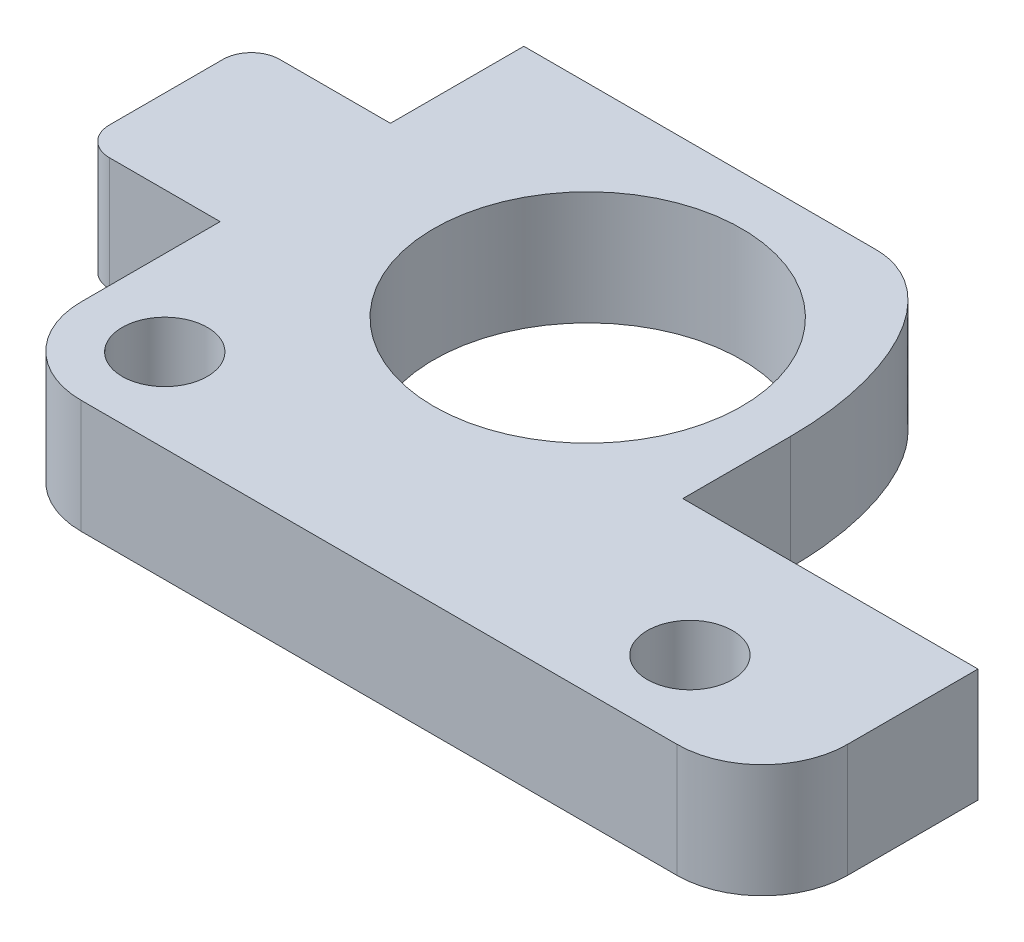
ISO-10303-21;
HEADER;
FILE_DESCRIPTION(('STEP AP214'),'2;1');
FILE_NAME('part.step','',(''),(''),'','','');
FILE_SCHEMA(('AUTOMOTIVE_DESIGN { 1 0 10303 214 1 1 1 1 }'));
ENDSEC;
DATA;
#1=APPLICATION_CONTEXT('core data for automotive mechanical design processes');
#2=APPLICATION_PROTOCOL_DEFINITION('international standard','automotive_design',2000,#1);
#3=PRODUCT_CONTEXT('',#1,'mechanical');
#4=PRODUCT('Part','Part','',(#3));
#5=PRODUCT_RELATED_PRODUCT_CATEGORY('part','',(#4));
#6=PRODUCT_DEFINITION_FORMATION('','',#4);
#7=PRODUCT_DEFINITION_CONTEXT('part definition',#1,'design');
#8=PRODUCT_DEFINITION('design','',#6,#7);
#9=PRODUCT_DEFINITION_SHAPE('','',#8);
#10=(LENGTH_UNIT() NAMED_UNIT(*) SI_UNIT(.MILLI.,.METRE.));
#11=(NAMED_UNIT(*) PLANE_ANGLE_UNIT() SI_UNIT($,.RADIAN.));
#12=(NAMED_UNIT(*) SI_UNIT($,.STERADIAN.) SOLID_ANGLE_UNIT());
#13=UNCERTAINTY_MEASURE_WITH_UNIT(LENGTH_MEASURE(1.E-05),#10,'distance_accuracy_value','');
#14=(GEOMETRIC_REPRESENTATION_CONTEXT(3) GLOBAL_UNCERTAINTY_ASSIGNED_CONTEXT((#13)) GLOBAL_UNIT_ASSIGNED_CONTEXT((#10,
#11,#12)) REPRESENTATION_CONTEXT('',''));
#15=CARTESIAN_POINT('',(0.,0.,0.));
#16=DIRECTION('',(0.,0.,1.));
#17=DIRECTION('',(1.,0.,0.));
#18=AXIS2_PLACEMENT_3D('',#15,#16,#17);
#19=CARTESIAN_POINT('',(-17.4,-2.,1.825));
#20=DIRECTION('',(0.,1.,0.));
#21=DIRECTION('',(0.,0.,1.));
#22=AXIS2_PLACEMENT_3D('',#19,#20,#21);
#23=CYLINDRICAL_SURFACE('',#22,1.);
#24=DIRECTION('',(0.,1.,0.));
#25=VECTOR('',#24,1.);
#26=CARTESIAN_POINT('',(-17.4,-2.,0.825));
#27=LINE('',#26,#25);
#28=CARTESIAN_POINT('',(-17.4,-2.,0.825));
#29=VERTEX_POINT('',#28);
#30=CARTESIAN_POINT('',(-17.4,2.,0.825));
#31=VERTEX_POINT('',#30);
#32=EDGE_CURVE('E157',#29,#31,#27,.T.);
#33=ORIENTED_EDGE('',*,*,#32,.F.);
#34=CARTESIAN_POINT('',(-17.4,-2.,1.825));
#35=DIRECTION('',(0.,1.,0.));
#36=DIRECTION('',(0.,0.,1.));
#37=AXIS2_PLACEMENT_3D('',#34,#35,#36);
#38=CIRCLE('',#37,1.);
#39=CARTESIAN_POINT('',(-18.4,-2.,1.825));
#40=VERTEX_POINT('',#39);
#41=EDGE_CURVE('E373',#29,#40,#38,.T.);
#42=ORIENTED_EDGE('',*,*,#41,.T.);
#43=DIRECTION('',(0.,1.,0.));
#44=VECTOR('',#43,1.);
#45=CARTESIAN_POINT('',(-18.4,-2.,1.825));
#46=LINE('',#45,#44);
#47=CARTESIAN_POINT('',(-18.4,2.,1.825));
#48=VERTEX_POINT('',#47);
#49=EDGE_CURVE('E160',#48,#40,#46,.F.);
#50=ORIENTED_EDGE('',*,*,#49,.F.);
#51=CARTESIAN_POINT('',(-17.4,2.,1.825));
#52=DIRECTION('',(0.,1.,0.));
#53=DIRECTION('',(0.,0.,1.));
#54=AXIS2_PLACEMENT_3D('',#51,#52,#53);
#55=CIRCLE('',#54,1.);
#56=EDGE_CURVE('E20',#48,#31,#55,.F.);
#57=ORIENTED_EDGE('',*,*,#56,.T.);
#58=EDGE_LOOP('',(#33,#42,#50,#57));
#59=FACE_BOUND('',#58,.T.);
#60=ADVANCED_FACE('F17',(#59),#23,.T.);
#61=CARTESIAN_POINT('',(-17.4,-2.,5.825));
#62=DIRECTION('',(0.,1.,0.));
#63=DIRECTION('',(0.,0.,1.));
#64=AXIS2_PLACEMENT_3D('',#61,#62,#63);
#65=CYLINDRICAL_SURFACE('',#64,1.);
#66=DIRECTION('',(0.,1.,0.));
#67=VECTOR('',#66,1.);
#68=CARTESIAN_POINT('',(-18.4,-2.,5.825));
#69=LINE('',#68,#67);
#70=CARTESIAN_POINT('',(-18.4,-2.,5.825));
#71=VERTEX_POINT('',#70);
#72=CARTESIAN_POINT('',(-18.4,2.,5.825));
#73=VERTEX_POINT('',#72);
#74=EDGE_CURVE('E259',#71,#73,#69,.T.);
#75=ORIENTED_EDGE('',*,*,#74,.F.);
#76=CARTESIAN_POINT('',(-17.4,-2.,5.825));
#77=DIRECTION('',(0.,1.,0.));
#78=DIRECTION('',(0.,0.,1.));
#79=AXIS2_PLACEMENT_3D('',#76,#77,#78);
#80=CIRCLE('',#79,1.);
#81=CARTESIAN_POINT('',(-17.4,-2.,6.825));
#82=VERTEX_POINT('',#81);
#83=EDGE_CURVE('E423',#71,#82,#80,.T.);
#84=ORIENTED_EDGE('',*,*,#83,.T.);
#85=DIRECTION('',(0.,1.,0.));
#86=VECTOR('',#85,1.);
#87=CARTESIAN_POINT('',(-17.4,-2.,6.825));
#88=LINE('',#87,#86);
#89=CARTESIAN_POINT('',(-17.4,2.,6.825));
#90=VERTEX_POINT('',#89);
#91=EDGE_CURVE('E252',#90,#82,#88,.F.);
#92=ORIENTED_EDGE('',*,*,#91,.F.);
#93=CARTESIAN_POINT('',(-17.4,2.,5.825));
#94=DIRECTION('',(0.,1.,0.));
#95=DIRECTION('',(0.,0.,1.));
#96=AXIS2_PLACEMENT_3D('',#93,#94,#95);
#97=CIRCLE('',#96,1.);
#98=EDGE_CURVE('E163',#90,#73,#97,.F.);
#99=ORIENTED_EDGE('',*,*,#98,.T.);
#100=EDGE_LOOP('',(#75,#84,#92,#99));
#101=FACE_BOUND('',#100,.T.);
#102=ADVANCED_FACE('F427',(#101),#65,.T.);
#103=CARTESIAN_POINT('',(0.,-2.,0.));
#104=DIRECTION('',(0.,1.,0.));
#105=DIRECTION('',(0.,0.,1.));
#106=AXIS2_PLACEMENT_3D('',#103,#104,#105);
#107=PLANE('',#106);
#108=CARTESIAN_POINT('',(-4.1,-2.,3.275));
#109=DIRECTION('',(0.,1.,0.));
#110=DIRECTION('',(0.,0.,1.));
#111=AXIS2_PLACEMENT_3D('',#108,#109,#110);
#112=CIRCLE('',#111,5.425);
#113=CARTESIAN_POINT('',(-4.1,-2.,8.7));
#114=VERTEX_POINT('',#113);
#115=EDGE_CURVE('E207',#114,#114,#112,.T.);
#116=ORIENTED_EDGE('',*,*,#115,.T.);
#117=EDGE_LOOP('',(#116));
#118=FACE_BOUND('',#117,.T.);
#119=CARTESIAN_POINT('',(-10.5,-2.,11.775));
#120=DIRECTION('',(0.,1.,0.));
#121=DIRECTION('',(0.,0.,1.));
#122=AXIS2_PLACEMENT_3D('',#119,#120,#121);
#123=CIRCLE('',#122,1.5);
#124=CARTESIAN_POINT('',(-10.5,-2.,13.275));
#125=VERTEX_POINT('',#124);
#126=EDGE_CURVE('E397',#125,#125,#123,.T.);
#127=ORIENTED_EDGE('',*,*,#126,.T.);
#128=EDGE_LOOP('',(#127));
#129=FACE_BOUND('',#128,.T.);
#130=CARTESIAN_POINT('',(8.,-2.,11.775));
#131=DIRECTION('',(0.,1.,0.));
#132=DIRECTION('',(0.,0.,1.));
#133=AXIS2_PLACEMENT_3D('',#130,#131,#132);
#134=CIRCLE('',#133,1.5);
#135=CARTESIAN_POINT('',(8.,-2.,13.275));
#136=VERTEX_POINT('',#135);
#137=EDGE_CURVE('E399',#136,#136,#134,.T.);
#138=ORIENTED_EDGE('',*,*,#137,.T.);
#139=EDGE_LOOP('',(#138));
#140=FACE_BOUND('',#139,.T.);
#141=CARTESIAN_POINT('',(10.5,-2.,11.725));
#142=DIRECTION('',(0.,1.,0.));
#143=DIRECTION('',(0.,0.,1.));
#144=AXIS2_PLACEMENT_3D('',#141,#142,#143);
#145=CIRCLE('',#144,3.);
#146=CARTESIAN_POINT('',(10.5,-2.,14.725));
#147=VERTEX_POINT('',#146);
#148=CARTESIAN_POINT('',(13.5,-2.,11.725));
#149=VERTEX_POINT('',#148);
#150=EDGE_CURVE('E215',#147,#149,#145,.T.);
#151=ORIENTED_EDGE('',*,*,#150,.F.);
#152=DIRECTION('',(1.,0.,0.));
#153=VECTOR('',#152,1.);
#154=CARTESIAN_POINT('',(-10.5,-2.,14.725));
#155=LINE('',#154,#153);
#156=CARTESIAN_POINT('',(-10.5,-2.,14.725));
#157=VERTEX_POINT('',#156);
#158=EDGE_CURVE('E234',#157,#147,#155,.T.);
#159=ORIENTED_EDGE('',*,*,#158,.F.);
#160=CARTESIAN_POINT('',(-10.5,-2.,11.725));
#161=DIRECTION('',(0.,1.,0.));
#162=DIRECTION('',(0.,0.,1.));
#163=AXIS2_PLACEMENT_3D('',#160,#161,#162);
#164=CIRCLE('',#163,3.);
#165=CARTESIAN_POINT('',(-13.5,-2.,11.725));
#166=VERTEX_POINT('',#165);
#167=EDGE_CURVE('E239',#166,#157,#164,.T.);
#168=ORIENTED_EDGE('',*,*,#167,.F.);
#169=DIRECTION('',(0.,0.,1.));
#170=VECTOR('',#169,1.);
#171=CARTESIAN_POINT('',(-13.5,-2.,6.825));
#172=LINE('',#171,#170);
#173=CARTESIAN_POINT('',(-13.5,-2.,6.825));
#174=VERTEX_POINT('',#173);
#175=EDGE_CURVE('E244',#174,#166,#172,.T.);
#176=ORIENTED_EDGE('',*,*,#175,.F.);
#177=DIRECTION('',(1.,0.,0.));
#178=VECTOR('',#177,1.);
#179=CARTESIAN_POINT('',(-17.4,-2.,6.825));
#180=LINE('',#179,#178);
#181=EDGE_CURVE('E249',#82,#174,#180,.T.);
#182=ORIENTED_EDGE('',*,*,#181,.F.);
#183=ORIENTED_EDGE('',*,*,#83,.F.);
#184=DIRECTION('',(0.,0.,1.));
#185=VECTOR('',#184,1.);
#186=CARTESIAN_POINT('',(-18.4,-2.,1.825));
#187=LINE('',#186,#185);
#188=EDGE_CURVE('E256',#40,#71,#187,.T.);
#189=ORIENTED_EDGE('',*,*,#188,.F.);
#190=ORIENTED_EDGE('',*,*,#41,.F.);
#191=DIRECTION('',(-1.,0.,0.));
#192=VECTOR('',#191,1.);
#193=CARTESIAN_POINT('',(-13.5,-2.,0.825));
#194=LINE('',#193,#192);
#195=CARTESIAN_POINT('',(-13.5,-2.,0.825));
#196=VERTEX_POINT('',#195);
#197=EDGE_CURVE('E172',#196,#29,#194,.T.);
#198=ORIENTED_EDGE('',*,*,#197,.F.);
#199=DIRECTION('',(0.,0.,1.));
#200=VECTOR('',#199,1.);
#201=CARTESIAN_POINT('',(-13.5,-2.,-3.875));
#202=LINE('',#201,#200);
#203=CARTESIAN_POINT('',(-13.5,-2.,-3.875));
#204=VERTEX_POINT('',#203);
#205=EDGE_CURVE('E175',#204,#196,#202,.T.);
#206=ORIENTED_EDGE('',*,*,#205,.F.);
#207=DIRECTION('',(-1.,0.,0.));
#208=VECTOR('',#207,1.);
#209=CARTESIAN_POINT('',(-1.1,-2.,-3.875));
#210=LINE('',#209,#208);
#211=CARTESIAN_POINT('',(-1.10000021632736,-2.,-3.87509362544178));
#212=VERTEX_POINT('',#211);
#213=EDGE_CURVE('E273',#212,#204,#210,.T.);
#214=ORIENTED_EDGE('',*,*,#213,.F.);
#215=CARTESIAN_POINT('',(-1.10000043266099,-2.,-3.87518725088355));
#216=CARTESIAN_POINT('',(-1.06274428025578,-2.,-3.87528071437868));
#217=CARTESIAN_POINT('',(-1.02548420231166,-2.,-3.87452258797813));
#218=CARTESIAN_POINT('',(-0.951045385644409,-2.,-3.8712746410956));
#219=CARTESIAN_POINT('',(-0.913866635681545,-2.,-3.86878507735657));
#220=CARTESIAN_POINT('',(-0.839711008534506,-2.,-3.86204964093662));
#221=CARTESIAN_POINT('',(-0.802733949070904,-2.,-3.8578057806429));
#222=CARTESIAN_POINT('',(-0.729018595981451,-2.,-3.84759486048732));
#223=CARTESIAN_POINT('',(-0.692280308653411,-2.,-3.84162775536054));
#224=CARTESIAN_POINT('',(-0.619403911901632,-2.,-3.8281241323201));
#225=CARTESIAN_POINT('',(-0.583263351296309,-2.,-3.82060078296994));
#226=CARTESIAN_POINT('',(-0.511321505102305,-2.,-3.80408695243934));
#227=CARTESIAN_POINT('',(-0.475520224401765,-2.,-3.79509645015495));
#228=CARTESIAN_POINT('',(-0.36870194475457,-2.,-3.76590545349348));
#229=CARTESIAN_POINT('',(-0.298276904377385,-2.,-3.74348665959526));
#230=CARTESIAN_POINT('',(-0.159762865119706,-2.,-3.69317854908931));
#231=CARTESIAN_POINT('',(-0.091665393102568,-2.,-3.6653122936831));
#232=CARTESIAN_POINT('',(0.0423135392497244,-2.,-3.60471764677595));
#233=CARTESIAN_POINT('',(0.108195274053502,-2.,-3.57198986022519));
#234=CARTESIAN_POINT('',(0.237593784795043,-2.,-3.50186321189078));
#235=CARTESIAN_POINT('',(0.301105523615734,-2.,-3.4644550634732));
#236=CARTESIAN_POINT('',(0.425441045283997,-2.,-3.3854124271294));
#237=CARTESIAN_POINT('',(0.486264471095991,-2.,-3.34377738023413));
#238=CARTESIAN_POINT('',(0.643430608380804,-2.,-3.22873084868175));
#239=CARTESIAN_POINT('',(0.737434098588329,-2.,-3.15211675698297));
#240=CARTESIAN_POINT('',(0.918569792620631,-2.,-2.99114333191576));
#241=CARTESIAN_POINT('',(1.00569737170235,-2.,-2.90677886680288));
#242=CARTESIAN_POINT('',(1.17329338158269,-2.,-2.73133130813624));
#243=CARTESIAN_POINT('',(1.25374674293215,-2.,-2.64023384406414));
#244=CARTESIAN_POINT('',(1.40799411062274,-2.,-2.45263857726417));
#245=CARTESIAN_POINT('',(1.48178921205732,-2.,-2.35614166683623));
#246=CARTESIAN_POINT('',(1.66648124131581,-2.,-2.09832486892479));
#247=CARTESIAN_POINT('',(1.77246278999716,-2.,-1.93345782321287));
#248=CARTESIAN_POINT('',(1.92031631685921,-2.,-1.67975498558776));
#249=CARTESIAN_POINT('',(1.9677668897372,-2.,-1.59407958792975));
#250=CARTESIAN_POINT('',(2.05918956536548,-2.,-1.42089025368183));
#251=CARTESIAN_POINT('',(2.10316175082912,-2.,-1.33337636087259));
#252=CARTESIAN_POINT('',(2.23039865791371,-2.,-1.06781514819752));
#253=CARTESIAN_POINT('',(2.30864100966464,-2.,-0.887344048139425));
#254=CARTESIAN_POINT('',(2.45272252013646,-2.,-0.521614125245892));
#255=CARTESIAN_POINT('',(2.51856399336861,-2.,-0.336356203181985));
#256=CARTESIAN_POINT('',(2.63912132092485,-2.,0.0387631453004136));
#257=CARTESIAN_POINT('',(2.69377925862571,-2.,0.228643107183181));
#258=CARTESIAN_POINT('',(2.79220331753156,-2.,0.611285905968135));
#259=CARTESIAN_POINT('',(2.83596412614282,-2.,0.804050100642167));
#260=CARTESIAN_POINT('',(2.91319937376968,-2.,1.19172392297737));
#261=CARTESIAN_POINT('',(2.9466684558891,-2.,1.38663461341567));
#262=CARTESIAN_POINT('',(3.00313074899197,-2.,1.77474199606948));
#263=CARTESIAN_POINT('',(3.02628440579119,-2.,1.96791553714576));
#264=CARTESIAN_POINT('',(3.0633229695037,-2.,2.35502341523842));
#265=CARTESIAN_POINT('',(3.07721410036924,-2.,2.54895715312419));
#266=CARTESIAN_POINT('',(3.09100025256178,-2.,2.84001133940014));
#267=CARTESIAN_POINT('',(3.09442062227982,-2.,2.93697570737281));
#268=CARTESIAN_POINT('',(3.09895262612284,-2.,3.13095929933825));
#269=CARTESIAN_POINT('',(3.10006424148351,-2.,3.22797852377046));
#270=CARTESIAN_POINT('',(3.10003710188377,-2.,3.32500001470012));
#271=B_SPLINE_CURVE_WITH_KNOTS('',3,(#215,#216,#217,#218,#219,#220,#221,#222,#223,#224,#225,
#226,#227,#228,#229,#230,#231,#232,#233,#234,#235,#236,#237,#238,#239,#240,#241,#242,#243,#244,
#245,#246,#247,#248,#249,#250,#251,#252,#253,#254,#255,#256,#257,#258,#259,#260,#261,#262,#263,
#264,#265,#266,#267,#268,#269,#270),.UNSPECIFIED.,.F.,.F.,(4,2,2,2,2,2,2,2,2,2,2,2,2,2,2,2,2,2,
2,2,2,2,2,2,2,2,2,4),(0.,0.111761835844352,0.223507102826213,0.335124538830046,0.44674490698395,
0.557456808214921,0.668170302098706,0.889616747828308,1.11014527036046,1.33064637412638,
1.5515921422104,1.77256716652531,2.13578803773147,2.49925116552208,2.86351378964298,
3.22771639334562,3.81468902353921,4.10844475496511,4.40219349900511,4.99174724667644,
5.58119085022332,6.17361379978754,6.76632500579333,7.35934420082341,7.94278676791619,
8.52583689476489,8.81688672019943,9.10793891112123),.UNSPECIFIED.);
#272=CARTESIAN_POINT('',(3.10001855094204,-2.,3.32500000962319));
#273=VERTEX_POINT('',#272);
#274=EDGE_CURVE('E359',#212,#273,#271,.T.);
#275=ORIENTED_EDGE('',*,*,#274,.T.);
#276=DIRECTION('',(0.,0.,-1.));
#277=VECTOR('',#276,1.);
#278=CARTESIAN_POINT('',(3.1,-2.,7.125));
#279=LINE('',#278,#277);
#280=CARTESIAN_POINT('',(3.1,-2.,7.125));
#281=VERTEX_POINT('',#280);
#282=EDGE_CURVE('E417',#281,#273,#279,.T.);
#283=ORIENTED_EDGE('',*,*,#282,.F.);
#284=DIRECTION('',(-1.,0.,0.));
#285=VECTOR('',#284,1.);
#286=CARTESIAN_POINT('',(13.5,-2.,7.125));
#287=LINE('',#286,#285);
#288=CARTESIAN_POINT('',(13.5,-2.,7.125));
#289=VERTEX_POINT('',#288);
#290=EDGE_CURVE('E226',#289,#281,#287,.T.);
#291=ORIENTED_EDGE('',*,*,#290,.F.);
#292=DIRECTION('',(0.,0.,-1.));
#293=VECTOR('',#292,1.);
#294=CARTESIAN_POINT('',(13.5,-2.,11.725));
#295=LINE('',#294,#293);
#296=EDGE_CURVE('E214',#149,#289,#295,.T.);
#297=ORIENTED_EDGE('',*,*,#296,.F.);
#298=EDGE_LOOP('',(#151,#159,#168,#176,#182,#183,#189,#190,#198,#206,#214,#275,#283,#291,#297));
#299=FACE_BOUND('',#298,.T.);
#300=ADVANCED_FACE('F371',(#118,#129,#140,#299),#107,.F.);
#301=CARTESIAN_POINT('',(3.1,-2.,7.125));
#302=DIRECTION('',(1.,0.,0.));
#303=DIRECTION('',(0.,0.,-1.));
#304=AXIS2_PLACEMENT_3D('',#301,#302,#303);
#305=PLANE('',#304);
#306=DIRECTION('',(0.,1.,0.));
#307=VECTOR('',#306,1.);
#308=CARTESIAN_POINT('',(3.1,-2.,7.125));
#309=LINE('',#308,#307);
#310=CARTESIAN_POINT('',(3.1,2.,7.125));
#311=VERTEX_POINT('',#310);
#312=EDGE_CURVE('E227',#281,#311,#309,.T.);
#313=ORIENTED_EDGE('',*,*,#312,.F.);
#314=ORIENTED_EDGE('',*,*,#282,.T.);
#315=CARTESIAN_POINT('',(3.10003710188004,2.,3.3250000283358));
#316=DIRECTION('',(0.,-1.,0.));
#317=VECTOR('',#316,1.);
#318=LINE('',#315,#317);
#319=CARTESIAN_POINT('',(3.10001855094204,2.,3.32500000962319));
#320=VERTEX_POINT('',#319);
#321=EDGE_CURVE('E327',#273,#320,#318,.F.);
#322=ORIENTED_EDGE('',*,*,#321,.T.);
#323=DIRECTION('',(0.,0.,1.));
#324=VECTOR('',#323,1.);
#325=CARTESIAN_POINT('',(3.1,2.,0.));
#326=LINE('',#325,#324);
#327=EDGE_CURVE('E203',#311,#320,#326,.F.);
#328=ORIENTED_EDGE('',*,*,#327,.F.);
#329=EDGE_LOOP('',(#313,#314,#322,#328));
#330=FACE_BOUND('',#329,.T.);
#331=ADVANCED_FACE('F291',(#330),#305,.T.);
#332=CARTESIAN_POINT('',(-1.231925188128,-2.,-3.871447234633));
#333=CARTESIAN_POINT('',(-0.9793425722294,-2.,-3.885054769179));
#334=CARTESIAN_POINT('',(-0.5480025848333,-2.,-3.835776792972));
#335=CARTESIAN_POINT('',(0.1671228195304,-2.,-3.584334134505));
#336=CARTESIAN_POINT('',(0.8789481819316,-2.,-3.081369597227));
#337=CARTESIAN_POINT('',(1.561186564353,-2.,-2.29964631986));
#338=CARTESIAN_POINT('',(2.10916645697,-2.,-1.378812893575));
#339=CARTESIAN_POINT('',(2.541157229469,-2.,-0.3377988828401));
#340=CARTESIAN_POINT('',(2.861422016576,-2.,0.8189785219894));
#341=CARTESIAN_POINT('',(3.06380102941,-2.,2.097901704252));
#342=CARTESIAN_POINT('',(3.107200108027,-2.,3.045344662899));
#343=CARTESIAN_POINT('',(3.097927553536,-2.,3.551157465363));
#344=(BOUNDED_CURVE() B_SPLINE_CURVE(3,(#332,#333,#334,#335,#336,#337,#338,#339,#340,#341,#342,
#343),.UNSPECIFIED.,.F.,.F.) B_SPLINE_CURVE_WITH_KNOTS((4,1,1,1,1,1,1,1,1,4),(0.,0.0625,0.125,
0.25,0.375,0.5,0.625,0.75,0.875,1.),
.UNSPECIFIED.) CURVE() GEOMETRIC_REPRESENTATION_ITEM() RATIONAL_B_SPLINE_CURVE((1.,1.,1.,1.,1.,
1.,1.,1.,1.,1.,1.,1.)) REPRESENTATION_ITEM(''));
#345=DIRECTION('',(0.,1.,0.));
#346=VECTOR('',#345,1.);
#347=SURFACE_OF_LINEAR_EXTRUSION('',#344,#346);
#348=CARTESIAN_POINT('',(3.10003710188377,2.,3.32500001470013));
#349=CARTESIAN_POINT('',(3.10007453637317,2.,3.2140764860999));
#350=CARTESIAN_POINT('',(3.09861347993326,2.,3.10315693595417));
#351=CARTESIAN_POINT('',(3.09266903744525,2.,2.88139930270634));
#352=CARTESIAN_POINT('',(3.08818566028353,2.,2.77056121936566));
#353=CARTESIAN_POINT('',(3.07012608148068,2.,2.43757906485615));
#354=CARTESIAN_POINT('',(3.05193981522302,2.,2.21566843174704));
#355=CARTESIAN_POINT('',(3.00332272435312,2.,1.77290547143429));
#356=CARTESIAN_POINT('',(2.97287611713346,2.,1.5520548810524));
#357=CARTESIAN_POINT('',(2.8986770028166,2.,1.11027900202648));
#358=CARTESIAN_POINT('',(2.85479243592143,2.,0.889375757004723));
#359=CARTESIAN_POINT('',(2.75333775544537,2.,0.450930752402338));
#360=CARTESIAN_POINT('',(2.69578180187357,2.,0.233385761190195));
#361=CARTESIAN_POINT('',(2.59838342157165,2.,-0.0894541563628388));
#362=CARTESIAN_POINT('',(2.56409040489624,2.,-0.196442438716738));
#363=CARTESIAN_POINT('',(2.49171222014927,2.,-0.409127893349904));
#364=CARTESIAN_POINT('',(2.45362720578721,2.,-0.514825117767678));
#365=CARTESIAN_POINT('',(2.36121377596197,2.,-0.756757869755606));
#366=CARTESIAN_POINT('',(2.30547713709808,2.,-0.892459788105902));
#367=CARTESIAN_POINT('',(2.18676976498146,2.,-1.16067094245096));
#368=CARTESIAN_POINT('',(2.12379903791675,2.,-1.29318018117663));
#369=CARTESIAN_POINT('',(1.99027434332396,2.,-1.55414631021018));
#370=CARTESIAN_POINT('',(1.91972930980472,2.,-1.68260774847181));
#371=CARTESIAN_POINT('',(1.77028706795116,2.,-1.93456838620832));
#372=CARTESIAN_POINT('',(1.69139198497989,2.,-2.05806883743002));
#373=CARTESIAN_POINT('',(1.53714118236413,2.,-2.28103440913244));
#374=CARTESIAN_POINT('',(1.46300492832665,2.,-2.38134197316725));
#375=CARTESIAN_POINT('',(1.30784214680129,2.,-2.57655108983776));
#376=CARTESIAN_POINT('',(1.2268143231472,2.,-2.67145161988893));
#377=CARTESIAN_POINT('',(1.05764352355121,2.,-2.85442604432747));
#378=CARTESIAN_POINT('',(0.969511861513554,2.,-2.94251037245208));
#379=CARTESIAN_POINT('',(0.786057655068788,2.,-3.11083030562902));
#380=CARTESIAN_POINT('',(0.690739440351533,2.,-3.19107057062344));
#381=CARTESIAN_POINT('',(0.526103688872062,2.,-3.31567313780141));
#382=CARTESIAN_POINT('',(0.458989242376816,2.,-3.3629463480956));
#383=CARTESIAN_POINT('',(0.321394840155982,2.,-3.45232204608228));
#384=CARTESIAN_POINT('',(0.250915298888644,2.,-3.49442516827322));
#385=CARTESIAN_POINT('',(0.107044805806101,2.,-3.57281416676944));
#386=CARTESIAN_POINT('',(0.0336625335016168,2.,-3.60911595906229));
#387=CARTESIAN_POINT('',(-0.115826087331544,2.,-3.67563823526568));
#388=CARTESIAN_POINT('',(-0.191932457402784,2.,-3.70585867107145));
#389=CARTESIAN_POINT('',(-0.335691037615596,2.,-3.75556163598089));
#390=CARTESIAN_POINT('',(-0.403026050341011,2.,-3.77595674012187));
#391=CARTESIAN_POINT('',(-0.505045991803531,2.,-3.80252865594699));
#392=CARTESIAN_POINT('',(-0.539219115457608,2.,-3.81071528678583));
#393=CARTESIAN_POINT('',(-0.60786149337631,2.,-3.82574358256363));
#394=CARTESIAN_POINT('',(-0.642330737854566,2.,-3.83258529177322));
#395=CARTESIAN_POINT('',(-0.711793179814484,2.,-3.84484062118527));
#396=CARTESIAN_POINT('',(-0.746788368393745,2.,-3.85024300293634));
#397=CARTESIAN_POINT('',(-0.816989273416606,2.,-3.85948306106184));
#398=CARTESIAN_POINT('',(-0.85219501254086,2.,-3.86332056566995));
#399=CARTESIAN_POINT('',(-0.922802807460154,2.,-3.86941073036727));
#400=CARTESIAN_POINT('',(-0.958205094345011,2.,-3.87166070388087));
#401=CARTESIAN_POINT('',(-1.02907290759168,2.,-3.8745928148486));
#402=CARTESIAN_POINT('',(-1.06453843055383,2.,-3.87527503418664));
#403=CARTESIAN_POINT('',(-1.10000043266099,2.,-3.87518725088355));
#404=B_SPLINE_CURVE_WITH_KNOTS('',3,(#348,#349,#350,#351,#352,#353,#354,#355,#356,#357,#358,
#359,#360,#361,#362,#363,#364,#365,#366,#367,#368,#369,#370,#371,#372,#373,#374,#375,#376,#377,
#378,#379,#380,#381,#382,#383,#384,#385,#386,#387,#388,#389,#390,#391,#392,#393,#394,#395,#396,
#397,#398,#399,#400,#401,#402,#403),.UNSPECIFIED.,.F.,.F.,(4,2,2,2,2,2,2,2,2,2,2,2,2,2,2,2,2,2,
2,2,2,2,2,2,2,2,2,4),(0.,0.332751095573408,0.665501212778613,1.33310256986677,2.00156608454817,
2.67682196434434,3.35138148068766,3.6883704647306,4.02534579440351,4.46525038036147,
4.90515459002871,5.34454551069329,5.78382485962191,6.15775547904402,6.53175658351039,
6.90517337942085,7.27836697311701,7.5244392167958,7.77048123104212,8.01583618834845,
8.26119308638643,8.47202715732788,8.57742538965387,8.6828201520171,8.78901521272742,
8.89522192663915,9.00160794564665,9.10798840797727),.UNSPECIFIED.);
#405=CARTESIAN_POINT('',(-1.10000021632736,2.,-3.87509362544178));
#406=VERTEX_POINT('',#405);
#407=EDGE_CURVE('E200',#320,#406,#404,.T.);
#408=ORIENTED_EDGE('',*,*,#407,.F.);
#409=ORIENTED_EDGE('',*,*,#321,.F.);
#410=ORIENTED_EDGE('',*,*,#274,.F.);
#411=CARTESIAN_POINT('',(-1.10000043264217,-2.,-3.87518725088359));
#412=DIRECTION('',(0.,1.,0.));
#413=VECTOR('',#412,1.);
#414=LINE('',#411,#413);
#415=EDGE_CURVE('E358',#406,#212,#414,.F.);
#416=ORIENTED_EDGE('',*,*,#415,.F.);
#417=EDGE_LOOP('',(#408,#409,#410,#416));
#418=FACE_BOUND('',#417,.T.);
#419=ADVANCED_FACE('F285',(#418),#347,.F.);
#420=CARTESIAN_POINT('',(-1.1,-2.,-3.875));
#421=DIRECTION('',(0.,0.,-1.));
#422=DIRECTION('',(-1.,0.,0.));
#423=AXIS2_PLACEMENT_3D('',#420,#421,#422);
#424=PLANE('',#423);
#425=ORIENTED_EDGE('',*,*,#415,.T.);
#426=ORIENTED_EDGE('',*,*,#213,.T.);
#427=DIRECTION('',(0.,1.,0.));
#428=VECTOR('',#427,1.);
#429=CARTESIAN_POINT('',(-13.5,-2.,-3.875));
#430=LINE('',#429,#428);
#431=CARTESIAN_POINT('',(-13.5,2.,-3.875));
#432=VERTEX_POINT('',#431);
#433=EDGE_CURVE('E269',#432,#204,#430,.F.);
#434=ORIENTED_EDGE('',*,*,#433,.F.);
#435=DIRECTION('',(1.,0.,0.));
#436=VECTOR('',#435,1.);
#437=CARTESIAN_POINT('',(0.,2.,-3.875));
#438=LINE('',#437,#436);
#439=EDGE_CURVE('E192',#406,#432,#438,.F.);
#440=ORIENTED_EDGE('',*,*,#439,.F.);
#441=EDGE_LOOP('',(#425,#426,#434,#440));
#442=FACE_BOUND('',#441,.T.);
#443=ADVANCED_FACE('F290',(#442),#424,.T.);
#444=CARTESIAN_POINT('',(-13.5,-2.,-3.875));
#445=DIRECTION('',(-1.,0.,0.));
#446=DIRECTION('',(0.,0.,1.));
#447=AXIS2_PLACEMENT_3D('',#444,#445,#446);
#448=PLANE('',#447);
#449=ORIENTED_EDGE('',*,*,#433,.T.);
#450=ORIENTED_EDGE('',*,*,#205,.T.);
#451=DIRECTION('',(0.,1.,0.));
#452=VECTOR('',#451,1.);
#453=CARTESIAN_POINT('',(-13.5,-2.,0.825));
#454=LINE('',#453,#452);
#455=CARTESIAN_POINT('',(-13.5,2.,0.825));
#456=VERTEX_POINT('',#455);
#457=EDGE_CURVE('E174',#456,#196,#454,.F.);
#458=ORIENTED_EDGE('',*,*,#457,.F.);
#459=DIRECTION('',(0.,0.,1.));
#460=VECTOR('',#459,1.);
#461=CARTESIAN_POINT('',(-13.5,2.,0.));
#462=LINE('',#461,#460);
#463=EDGE_CURVE('E181',#432,#456,#462,.T.);
#464=ORIENTED_EDGE('',*,*,#463,.F.);
#465=EDGE_LOOP('',(#449,#450,#458,#464));
#466=FACE_BOUND('',#465,.T.);
#467=ADVANCED_FACE('F366',(#466),#448,.T.);
#468=CARTESIAN_POINT('',(-13.5,-2.,0.825));
#469=DIRECTION('',(0.,0.,-1.));
#470=DIRECTION('',(-1.,0.,0.));
#471=AXIS2_PLACEMENT_3D('',#468,#469,#470);
#472=PLANE('',#471);
#473=ORIENTED_EDGE('',*,*,#457,.T.);
#474=ORIENTED_EDGE('',*,*,#197,.T.);
#475=ORIENTED_EDGE('',*,*,#32,.T.);
#476=DIRECTION('',(1.,0.,0.));
#477=VECTOR('',#476,1.);
#478=CARTESIAN_POINT('',(0.,2.,0.825));
#479=LINE('',#478,#477);
#480=EDGE_CURVE('E169',#456,#31,#479,.F.);
#481=ORIENTED_EDGE('',*,*,#480,.F.);
#482=EDGE_LOOP('',(#473,#474,#475,#481));
#483=FACE_BOUND('',#482,.T.);
#484=ADVANCED_FACE('F168',(#483),#472,.T.);
#485=CARTESIAN_POINT('',(-18.4,-2.,1.825));
#486=DIRECTION('',(-1.,0.,0.));
#487=DIRECTION('',(0.,0.,1.));
#488=AXIS2_PLACEMENT_3D('',#485,#486,#487);
#489=PLANE('',#488);
#490=ORIENTED_EDGE('',*,*,#49,.T.);
#491=ORIENTED_EDGE('',*,*,#188,.T.);
#492=ORIENTED_EDGE('',*,*,#74,.T.);
#493=DIRECTION('',(0.,0.,1.));
#494=VECTOR('',#493,1.);
#495=CARTESIAN_POINT('',(-18.4,2.,0.));
#496=LINE('',#495,#494);
#497=EDGE_CURVE('E183',#48,#73,#496,.T.);
#498=ORIENTED_EDGE('',*,*,#497,.F.);
#499=EDGE_LOOP('',(#490,#491,#492,#498));
#500=FACE_BOUND('',#499,.T.);
#501=ADVANCED_FACE('F480',(#500),#489,.T.);
#502=CARTESIAN_POINT('',(-17.4,-2.,6.825));
#503=DIRECTION('',(0.,0.,1.));
#504=DIRECTION('',(1.,0.,0.));
#505=AXIS2_PLACEMENT_3D('',#502,#503,#504);
#506=PLANE('',#505);
#507=ORIENTED_EDGE('',*,*,#91,.T.);
#508=ORIENTED_EDGE('',*,*,#181,.T.);
#509=DIRECTION('',(0.,1.,0.));
#510=VECTOR('',#509,1.);
#511=CARTESIAN_POINT('',(-13.5,-2.,6.825));
#512=LINE('',#511,#510);
#513=CARTESIAN_POINT('',(-13.5,2.,6.825));
#514=VERTEX_POINT('',#513);
#515=EDGE_CURVE('E245',#514,#174,#512,.F.);
#516=ORIENTED_EDGE('',*,*,#515,.F.);
#517=DIRECTION('',(1.,0.,0.));
#518=VECTOR('',#517,1.);
#519=CARTESIAN_POINT('',(0.,2.,6.825));
#520=LINE('',#519,#518);
#521=EDGE_CURVE('E189',#90,#514,#520,.T.);
#522=ORIENTED_EDGE('',*,*,#521,.F.);
#523=EDGE_LOOP('',(#507,#508,#516,#522));
#524=FACE_BOUND('',#523,.T.);
#525=ADVANCED_FACE('F476',(#524),#506,.T.);
#526=CARTESIAN_POINT('',(-13.5,-2.,6.825));
#527=DIRECTION('',(-1.,0.,0.));
#528=DIRECTION('',(0.,0.,1.));
#529=AXIS2_PLACEMENT_3D('',#526,#527,#528);
#530=PLANE('',#529);
#531=ORIENTED_EDGE('',*,*,#515,.T.);
#532=ORIENTED_EDGE('',*,*,#175,.T.);
#533=DIRECTION('',(0.,1.,0.));
#534=VECTOR('',#533,1.);
#535=CARTESIAN_POINT('',(-13.5,-2.,11.725));
#536=LINE('',#535,#534);
#537=CARTESIAN_POINT('',(-13.5,2.,11.725));
#538=VERTEX_POINT('',#537);
#539=EDGE_CURVE('E240',#538,#166,#536,.F.);
#540=ORIENTED_EDGE('',*,*,#539,.F.);
#541=DIRECTION('',(0.,0.,1.));
#542=VECTOR('',#541,1.);
#543=CARTESIAN_POINT('',(-13.5,2.,0.));
#544=LINE('',#543,#542);
#545=EDGE_CURVE('E351',#514,#538,#544,.T.);
#546=ORIENTED_EDGE('',*,*,#545,.F.);
#547=EDGE_LOOP('',(#531,#532,#540,#546));
#548=FACE_BOUND('',#547,.T.);
#549=ADVANCED_FACE('F473',(#548),#530,.T.);
#550=CARTESIAN_POINT('',(-10.5,-2.,11.725));
#551=DIRECTION('',(0.,1.,0.));
#552=DIRECTION('',(0.,0.,1.));
#553=AXIS2_PLACEMENT_3D('',#550,#551,#552);
#554=CYLINDRICAL_SURFACE('',#553,3.);
#555=ORIENTED_EDGE('',*,*,#539,.T.);
#556=ORIENTED_EDGE('',*,*,#167,.T.);
#557=DIRECTION('',(0.,1.,0.));
#558=VECTOR('',#557,1.);
#559=CARTESIAN_POINT('',(-10.5,-2.,14.725));
#560=LINE('',#559,#558);
#561=CARTESIAN_POINT('',(-10.5,2.,14.725));
#562=VERTEX_POINT('',#561);
#563=EDGE_CURVE('E235',#562,#157,#560,.F.);
#564=ORIENTED_EDGE('',*,*,#563,.F.);
#565=CARTESIAN_POINT('',(-10.5,2.,11.725));
#566=DIRECTION('',(0.,1.,0.));
#567=DIRECTION('',(0.,0.,1.));
#568=AXIS2_PLACEMENT_3D('',#565,#566,#567);
#569=CIRCLE('',#568,3.);
#570=EDGE_CURVE('E348',#538,#562,#569,.T.);
#571=ORIENTED_EDGE('',*,*,#570,.F.);
#572=EDGE_LOOP('',(#555,#556,#564,#571));
#573=FACE_BOUND('',#572,.T.);
#574=ADVANCED_FACE('F469',(#573),#554,.T.);
#575=CARTESIAN_POINT('',(-10.5,-2.,14.725));
#576=DIRECTION('',(0.,0.,1.));
#577=DIRECTION('',(1.,0.,0.));
#578=AXIS2_PLACEMENT_3D('',#575,#576,#577);
#579=PLANE('',#578);
#580=ORIENTED_EDGE('',*,*,#563,.T.);
#581=ORIENTED_EDGE('',*,*,#158,.T.);
#582=DIRECTION('',(0.,1.,0.));
#583=VECTOR('',#582,1.);
#584=CARTESIAN_POINT('',(10.5,-2.,14.725));
#585=LINE('',#584,#583);
#586=CARTESIAN_POINT('',(10.5,2.,14.725));
#587=VERTEX_POINT('',#586);
#588=EDGE_CURVE('E230',#587,#147,#585,.F.);
#589=ORIENTED_EDGE('',*,*,#588,.F.);
#590=DIRECTION('',(1.,0.,0.));
#591=VECTOR('',#590,1.);
#592=CARTESIAN_POINT('',(0.,2.,14.725));
#593=LINE('',#592,#591);
#594=EDGE_CURVE('E347',#562,#587,#593,.T.);
#595=ORIENTED_EDGE('',*,*,#594,.F.);
#596=EDGE_LOOP('',(#580,#581,#589,#595));
#597=FACE_BOUND('',#596,.T.);
#598=ADVANCED_FACE('F465',(#597),#579,.T.);
#599=CARTESIAN_POINT('',(10.5,-2.,11.725));
#600=DIRECTION('',(0.,1.,0.));
#601=DIRECTION('',(0.,0.,1.));
#602=AXIS2_PLACEMENT_3D('',#599,#600,#601);
#603=CYLINDRICAL_SURFACE('',#602,3.);
#604=ORIENTED_EDGE('',*,*,#588,.T.);
#605=ORIENTED_EDGE('',*,*,#150,.T.);
#606=DIRECTION('',(0.,1.,0.));
#607=VECTOR('',#606,1.);
#608=CARTESIAN_POINT('',(13.5,-2.,11.725));
#609=LINE('',#608,#607);
#610=CARTESIAN_POINT('',(13.5,2.,11.725));
#611=VERTEX_POINT('',#610);
#612=EDGE_CURVE('E210',#611,#149,#609,.F.);
#613=ORIENTED_EDGE('',*,*,#612,.F.);
#614=CARTESIAN_POINT('',(10.5,2.,11.725));
#615=DIRECTION('',(0.,1.,0.));
#616=DIRECTION('',(0.,0.,1.));
#617=AXIS2_PLACEMENT_3D('',#614,#615,#616);
#618=CIRCLE('',#617,3.);
#619=EDGE_CURVE('E343',#587,#611,#618,.T.);
#620=ORIENTED_EDGE('',*,*,#619,.F.);
#621=EDGE_LOOP('',(#604,#605,#613,#620));
#622=FACE_BOUND('',#621,.T.);
#623=ADVANCED_FACE('F462',(#622),#603,.T.);
#624=CARTESIAN_POINT('',(13.5,-2.,11.725));
#625=DIRECTION('',(1.,0.,0.));
#626=DIRECTION('',(0.,0.,-1.));
#627=AXIS2_PLACEMENT_3D('',#624,#625,#626);
#628=PLANE('',#627);
#629=ORIENTED_EDGE('',*,*,#612,.T.);
#630=ORIENTED_EDGE('',*,*,#296,.T.);
#631=DIRECTION('',(0.,1.,0.));
#632=VECTOR('',#631,1.);
#633=CARTESIAN_POINT('',(13.5,-2.,7.125));
#634=LINE('',#633,#632);
#635=CARTESIAN_POINT('',(13.5,2.,7.125));
#636=VERTEX_POINT('',#635);
#637=EDGE_CURVE('E40',#636,#289,#634,.F.);
#638=ORIENTED_EDGE('',*,*,#637,.F.);
#639=DIRECTION('',(0.,0.,1.));
#640=VECTOR('',#639,1.);
#641=CARTESIAN_POINT('',(13.5,2.,0.));
#642=LINE('',#641,#640);
#643=EDGE_CURVE('E221',#611,#636,#642,.F.);
#644=ORIENTED_EDGE('',*,*,#643,.F.);
#645=EDGE_LOOP('',(#629,#630,#638,#644));
#646=FACE_BOUND('',#645,.T.);
#647=ADVANCED_FACE('F458',(#646),#628,.T.);
#648=CARTESIAN_POINT('',(13.5,-2.,7.125));
#649=DIRECTION('',(0.,0.,-1.));
#650=DIRECTION('',(-1.,0.,0.));
#651=AXIS2_PLACEMENT_3D('',#648,#649,#650);
#652=PLANE('',#651);
#653=ORIENTED_EDGE('',*,*,#637,.T.);
#654=ORIENTED_EDGE('',*,*,#290,.T.);
#655=ORIENTED_EDGE('',*,*,#312,.T.);
#656=DIRECTION('',(1.,0.,0.));
#657=VECTOR('',#656,1.);
#658=CARTESIAN_POINT('',(0.,2.,7.125));
#659=LINE('',#658,#657);
#660=EDGE_CURVE('E216',#636,#311,#659,.F.);
#661=ORIENTED_EDGE('',*,*,#660,.F.);
#662=EDGE_LOOP('',(#653,#654,#655,#661));
#663=FACE_BOUND('',#662,.T.);
#664=ADVANCED_FACE('F454',(#663),#652,.T.);
#665=CARTESIAN_POINT('',(8.,-2.,11.775));
#666=DIRECTION('',(0.,1.,0.));
#667=DIRECTION('',(0.,0.,1.));
#668=AXIS2_PLACEMENT_3D('',#665,#666,#667);
#669=CYLINDRICAL_SURFACE('',#668,1.5);
#670=CARTESIAN_POINT('',(8.,2.,11.775));
#671=DIRECTION('',(0.,1.,0.));
#672=DIRECTION('',(0.,0.,1.));
#673=AXIS2_PLACEMENT_3D('',#670,#671,#672);
#674=CIRCLE('',#673,1.5);
#675=CARTESIAN_POINT('',(8.,2.,13.275));
#676=VERTEX_POINT('',#675);
#677=EDGE_CURVE('E220',#676,#676,#674,.F.);
#678=ORIENTED_EDGE('',*,*,#677,.F.);
#679=EDGE_LOOP('',(#678));
#680=FACE_BOUND('',#679,.T.);
#681=ORIENTED_EDGE('',*,*,#137,.F.);
#682=EDGE_LOOP('',(#681));
#683=FACE_BOUND('',#682,.T.);
#684=ADVANCED_FACE('F450',(#680,#683),#669,.F.);
#685=CARTESIAN_POINT('',(-10.5,-2.,11.775));
#686=DIRECTION('',(0.,1.,0.));
#687=DIRECTION('',(0.,0.,1.));
#688=AXIS2_PLACEMENT_3D('',#685,#686,#687);
#689=CYLINDRICAL_SURFACE('',#688,1.5);
#690=CARTESIAN_POINT('',(-10.5,2.,11.775));
#691=DIRECTION('',(0.,1.,0.));
#692=DIRECTION('',(0.,0.,1.));
#693=AXIS2_PLACEMENT_3D('',#690,#691,#692);
#694=CIRCLE('',#693,1.5);
#695=CARTESIAN_POINT('',(-10.5,2.,13.275));
#696=VERTEX_POINT('',#695);
#697=EDGE_CURVE('E27',#696,#696,#694,.F.);
#698=ORIENTED_EDGE('',*,*,#697,.F.);
#699=EDGE_LOOP('',(#698));
#700=FACE_BOUND('',#699,.T.);
#701=ORIENTED_EDGE('',*,*,#126,.F.);
#702=EDGE_LOOP('',(#701));
#703=FACE_BOUND('',#702,.T.);
#704=ADVANCED_FACE('F442',(#700,#703),#689,.F.);
#705=CARTESIAN_POINT('',(-4.1,-2.,3.275));
#706=DIRECTION('',(0.,1.,0.));
#707=DIRECTION('',(0.,0.,1.));
#708=AXIS2_PLACEMENT_3D('',#705,#706,#707);
#709=CYLINDRICAL_SURFACE('',#708,5.425);
#710=CARTESIAN_POINT('',(-4.1,2.,3.275));
#711=DIRECTION('',(0.,1.,0.));
#712=DIRECTION('',(0.,0.,1.));
#713=AXIS2_PLACEMENT_3D('',#710,#711,#712);
#714=CIRCLE('',#713,5.425);
#715=CARTESIAN_POINT('',(-4.1,2.,8.7));
#716=VERTEX_POINT('',#715);
#717=EDGE_CURVE('E11',#716,#716,#714,.F.);
#718=ORIENTED_EDGE('',*,*,#717,.F.);
#719=EDGE_LOOP('',(#718));
#720=FACE_BOUND('',#719,.T.);
#721=ORIENTED_EDGE('',*,*,#115,.F.);
#722=EDGE_LOOP('',(#721));
#723=FACE_BOUND('',#722,.T.);
#724=ADVANCED_FACE('F437',(#720,#723),#709,.F.);
#725=CARTESIAN_POINT('',(0.,2.,0.));
#726=DIRECTION('',(0.,1.,0.));
#727=DIRECTION('',(0.,0.,1.));
#728=AXIS2_PLACEMENT_3D('',#725,#726,#727);
#729=PLANE('',#728);
#730=ORIENTED_EDGE('',*,*,#717,.T.);
#731=EDGE_LOOP('',(#730));
#732=FACE_BOUND('',#731,.T.);
#733=ORIENTED_EDGE('',*,*,#697,.T.);
#734=EDGE_LOOP('',(#733));
#735=FACE_BOUND('',#734,.T.);
#736=ORIENTED_EDGE('',*,*,#677,.T.);
#737=EDGE_LOOP('',(#736));
#738=FACE_BOUND('',#737,.T.);
#739=ORIENTED_EDGE('',*,*,#643,.T.);
#740=ORIENTED_EDGE('',*,*,#660,.T.);
#741=ORIENTED_EDGE('',*,*,#327,.T.);
#742=ORIENTED_EDGE('',*,*,#407,.T.);
#743=ORIENTED_EDGE('',*,*,#439,.T.);
#744=ORIENTED_EDGE('',*,*,#463,.T.);
#745=ORIENTED_EDGE('',*,*,#480,.T.);
#746=ORIENTED_EDGE('',*,*,#56,.F.);
#747=ORIENTED_EDGE('',*,*,#497,.T.);
#748=ORIENTED_EDGE('',*,*,#98,.F.);
#749=ORIENTED_EDGE('',*,*,#521,.T.);
#750=ORIENTED_EDGE('',*,*,#545,.T.);
#751=ORIENTED_EDGE('',*,*,#570,.T.);
#752=ORIENTED_EDGE('',*,*,#594,.T.);
#753=ORIENTED_EDGE('',*,*,#619,.T.);
#754=EDGE_LOOP('',(#739,#740,#741,#742,#743,#744,#745,#746,#747,#748,#749,#750,#751,#752,#753));
#755=FACE_BOUND('',#754,.T.);
#756=ADVANCED_FACE('F178',(#732,#735,#738,#755),#729,.T.);
#757=CLOSED_SHELL('',(#60,#102,#300,#331,#419,#443,#467,#484,#501,#525,#549,#574,#598,#623,#647,
#664,#684,#704,#724,#756));
#758=MANIFOLD_SOLID_BREP('B1',#757);
#759=ADVANCED_BREP_SHAPE_REPRESENTATION('',(#18,#758),#14);
#760=SHAPE_DEFINITION_REPRESENTATION(#9,#759);
ENDSEC;
END-ISO-10303-21;
